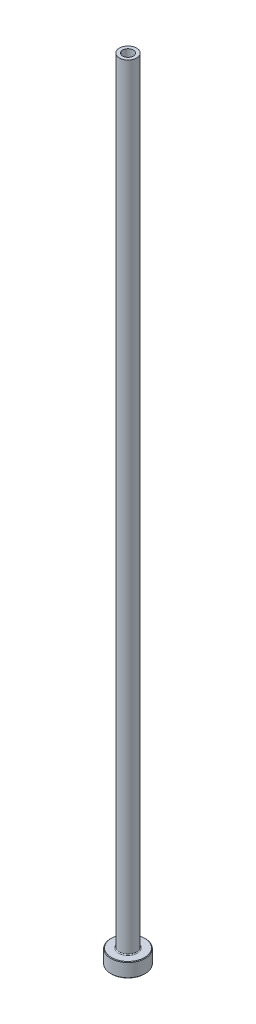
from build123d import *

# Parameters (mm, degrees)
FILLET1_R     = 0.3
CHAMFER1_SIZE = 0.2
CHAMFER3_SIZE = 0.5


with BuildPart() as part:
    # Sketch1 → Revolve1 (revolve)
    with BuildSketch(Plane.XY, mode=Mode.PRIVATE) as revolve1_sk:
        Polygon((-1.85, 275), (-3, 275), (-3, 5), (-6, 5), (-6, 0), (-2.1, 0), (-2.1, 218), (-1.85, 230), align=None)
    revolve(revolve1_sk.sketch.rotate(Axis((0, 92.187680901, 0), (0, -1, 0)), 270), axis=Axis((0, 92.187680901, 0), (0, -1, 0)))

    # Fillet1
    fillet1_edges = [part.edges().sort_by_distance(p)[0] for p in [
        (0, 5, -3),
    ]]
    fillet(fillet1_edges, radius=FILLET1_R)

    # Chamfer1
    chamfer1_edges = [part.edges().sort_by_distance(p)[0] for p in [
        (0, 0, -6),
        (0, 5, -6),
    ]]
    chamfer(chamfer1_edges, length=CHAMFER1_SIZE)

    # Chamfer3
    chamfer3_edges = [part.edges().sort_by_distance(p)[0] for p in [
        (0, 0, -2.1),
    ]]
    chamfer(chamfer3_edges, length=CHAMFER3_SIZE)


solid = part.part
